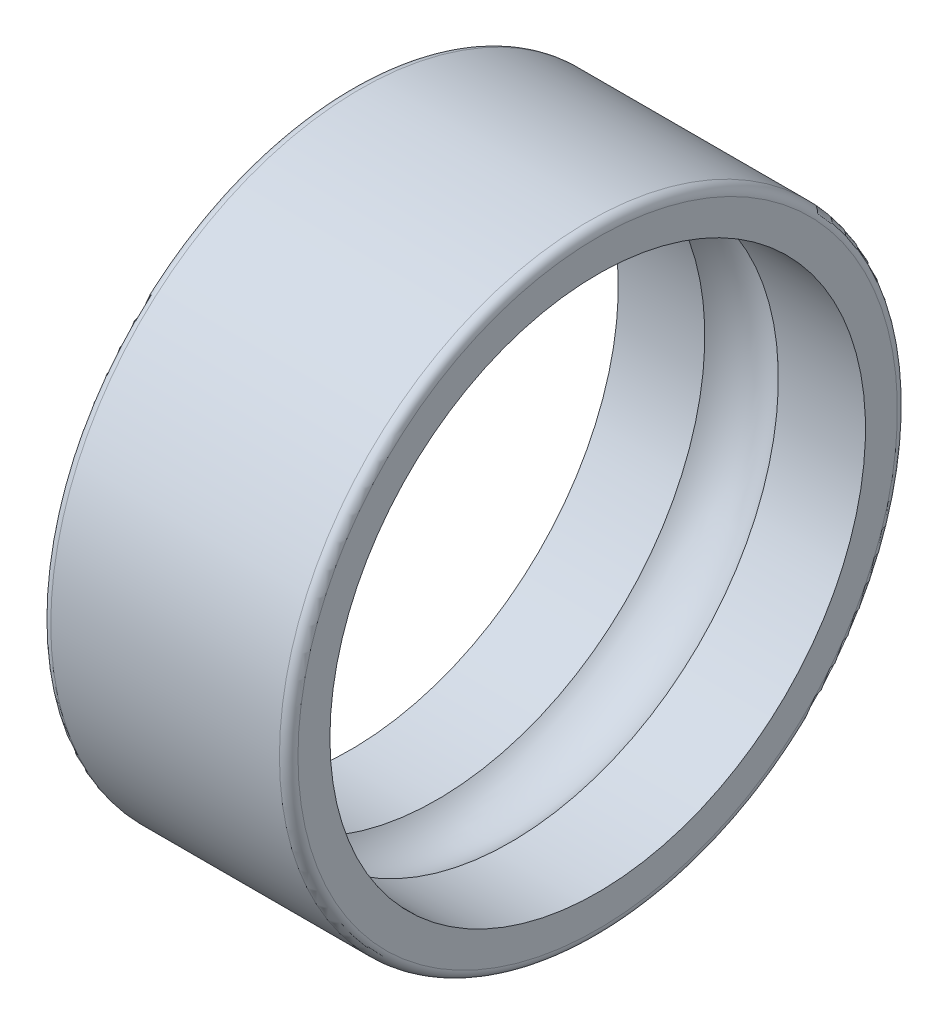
from build123d import *


with BuildPart() as part:
    # Skizze1 → Rotation1 (revolve)
    with BuildSketch(Plane(origin=(0, 0, 0), x_dir=(-1, 0, 0), z_dir=(0, 0, -1)), mode=Mode.PRIVATE) as rotation1_sk:
        with BuildLine():
            Line((-3.504880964, 4.333333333), (-2.095119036, 4.333333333))
            ThreePointArc((-2.095119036, 4.333333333), (-1.5, 4.583333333), (-0.904880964, 4.333333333))
            Line((-0.904880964, 4.333333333), (0.495119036, 4.333333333))
            Line((0.495119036, 4.333333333), (0.495119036, 4.85))
            ThreePointArc((0.495119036, 4.85), (0.451185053, 4.956066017), (0.345119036, 5))
            Line((0.345119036, 5), (-3.354880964, 5))
            ThreePointArc((-3.354880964, 5), (-3.460946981, 4.956066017), (-3.504880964, 4.85))
            Line((-3.504880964, 4.85), (-3.504880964, 4.333333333))
        make_face()
    revolve(rotation1_sk.sketch.rotate(Axis((3, 0, 0), (-1, 0, 0)), 270), axis=Axis((3, 0, 0), (-1, 0, 0)))


solid = part.part
